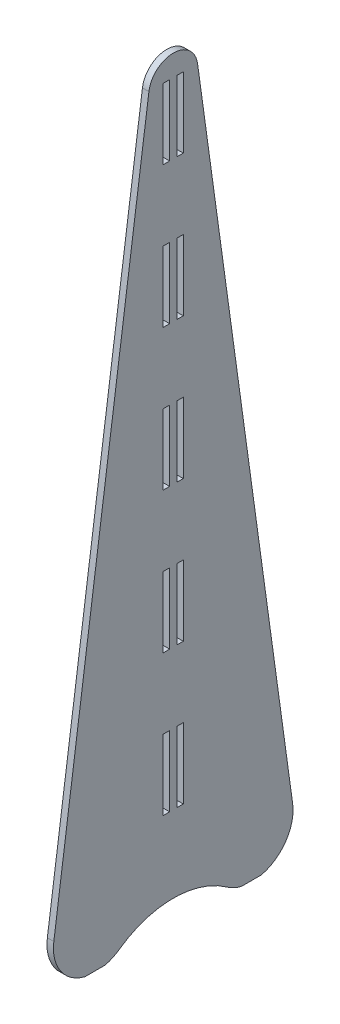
from build123d import *

# Parameters (mm, degrees)
ESQUISSE1_W        = 2.9
ESQUISSE1_H        = 31.555555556
BOSS_EXTRU_2_DEPTH = 2.9


with BuildPart() as part:
    # Esquisse1 → Boss.-Extru.2 (new body)
    with BuildSketch(Plane.ZY.offset(178.6)):
        with BuildLine():
            Line((-32.1, -187), (-41.1, -187))
            ThreePointArc((-41.1, -187), (-52.048659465, -179.352084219), (-55.078623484, -166.345044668))
            Line((-55.078623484, -166.345044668), (-12.496585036, 142))
            ThreePointArc((-12.496585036, 142), (-8.826588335, 148.788351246), (-1.6, 151.495196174))
            ThreePointArc((-1.6, 151.495196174), (5.626588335, 148.788351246), (9.296585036, 142))
            Line((9.296585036, 142), (51.878623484, -166.345044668))
            ThreePointArc((51.878623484, -166.345044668), (48.848659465, -179.352084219), (37.9, -187))
            Line((37.9, -187), (28.9, -187))
            ThreePointArc((28.9, -187), (25.574574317, -185.83014838), (22.528615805, -184.055565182))
            ThreePointArc((22.528615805, -184.055565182), (-1.6, -176.297773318), (-25.728615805, -184.055565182))
            ThreePointArc((-25.728615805, -184.055565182), (-28.774574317, -185.83014838), (-32.1, -187))
        make_face()
        with Locations((1.45, -126.222222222)):
            Rectangle(ESQUISSE1_W, ESQUISSE1_H, mode=Mode.SUBTRACT)
        with Locations((-4.65, -63.111111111)):
            Rectangle(ESQUISSE1_W, ESQUISSE1_H, mode=Mode.SUBTRACT)
        with Locations((-4.65, 0)):
            Rectangle(ESQUISSE1_W, ESQUISSE1_H, mode=Mode.SUBTRACT)
        with Locations((-4.65, 63.111111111)):
            Rectangle(ESQUISSE1_W, ESQUISSE1_H, mode=Mode.SUBTRACT)
        with Locations((-4.65, 126.222222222)):
            Rectangle(ESQUISSE1_W, ESQUISSE1_H, mode=Mode.SUBTRACT)
        with Locations((1.45, 63.111111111)):
            Rectangle(ESQUISSE1_W, ESQUISSE1_H, mode=Mode.SUBTRACT)
        with Locations((1.45, 0)):
            Rectangle(ESQUISSE1_W, ESQUISSE1_H, mode=Mode.SUBTRACT)
        with Locations((1.45, -63.111111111)):
            Rectangle(ESQUISSE1_W, ESQUISSE1_H, mode=Mode.SUBTRACT)
        with Locations((1.45, 126.222222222)):
            Rectangle(ESQUISSE1_W, ESQUISSE1_H, mode=Mode.SUBTRACT)
        with Locations((-4.65, -126.222222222)):
            Rectangle(ESQUISSE1_W, ESQUISSE1_H, mode=Mode.SUBTRACT)
    extrude(amount=-BOSS_EXTRU_2_DEPTH)


solid = part.part
